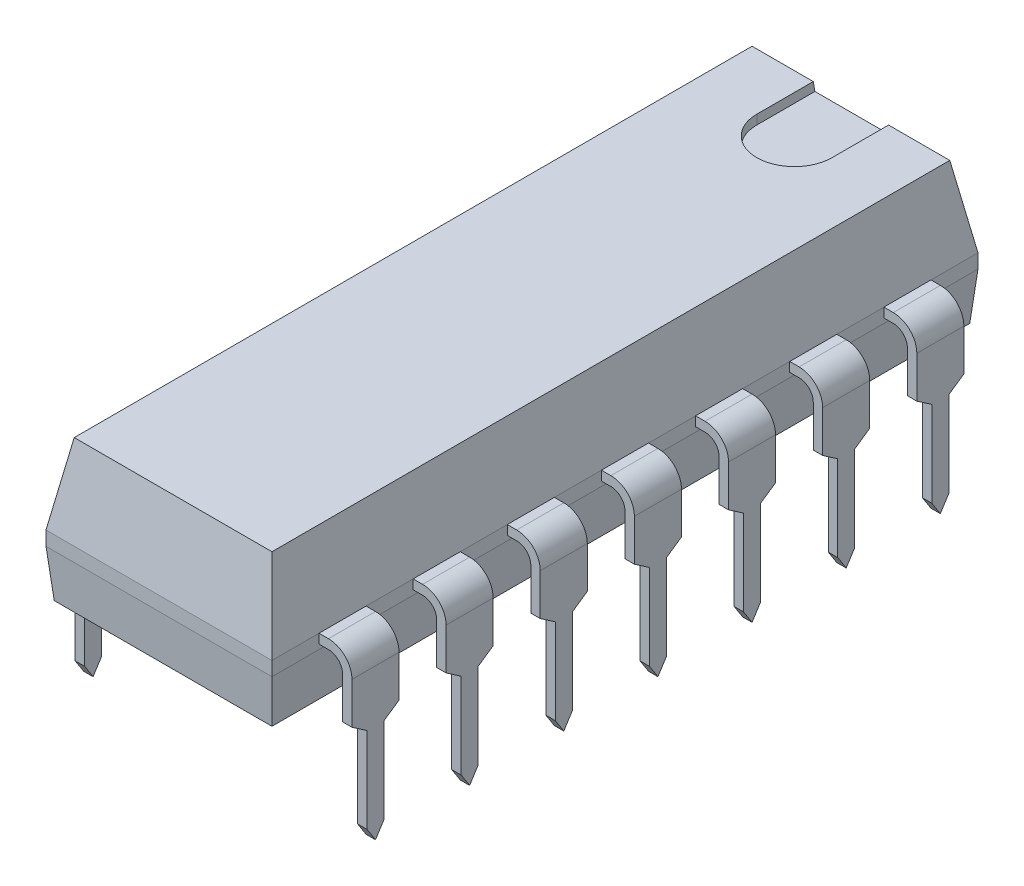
from build123d import *
from OCP.BRepFilletAPI import BRepFilletAPI_MakeChamfer

# Parameters (mm, degrees)
SKETCH1_W                = 19.05
SKETCH1_H                = 6.096
BASE_EXTRUDE_DEPTH       = 3.81
CHAMFER1_SIZE            = 2.159
CHAMFER1_SIZE2           = 0.380689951
CHAMFER2_SIZE            = 1.27
CHAMFER2_SIZE2           = 0.111110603
CUT_EXTRUDE1_DEPTH       = 0.254
BOSS_EXTRUDE_THIN1_DEPTH = 0.635
CUT_EXTRUDE2_DEPTH       = 0.254
CUT_EXTRUDE3_DEPTH       = 0.254
LPATTERN1_COUNT          = 7
LPATTERN1_PITCH          = 2.54
MIRROR1_COPY_1_DEPTH     = 0.635
MIRROR1_COPY_2_DEPTH     = 0.635
MIRROR1_COPY_3_DEPTH     = 0.635
MIRROR1_COPY_4_DEPTH     = 0.635
MIRROR1_COPY_5_DEPTH     = 0.635
MIRROR1_COPY_6_DEPTH     = 0.635
MIRROR1_COPY_7_DEPTH     = 0.254
MIRROR1_COPY_8_DEPTH     = 0.254
MIRROR1_COPY_9_DEPTH     = 0.254
MIRROR1_COPY_10_DEPTH    = 0.254
MIRROR1_COPY_11_DEPTH    = 0.254
MIRROR1_COPY_12_DEPTH    = 0.254
MIRROR1_COPY_13_DEPTH    = 0.254
MIRROR1_COPY_14_DEPTH    = 0.254
MIRROR1_COPY_15_DEPTH    = 0.254
MIRROR1_COPY_16_DEPTH    = 0.254
MIRROR1_COPY_17_DEPTH    = 0.254
MIRROR1_COPY_18_DEPTH    = 0.254


with BuildPart() as part:
    # Sketch1 → Base-Extrude (new body)
    with BuildSketch(Plane(origin=(0, 0.381, 0), x_dir=(0, 0, -1), z_dir=(0, 1, 0))):
        with Locations((-7.62, -3.81)):
            Rectangle(SKETCH1_W, SKETCH1_H)
    extrude(amount=BASE_EXTRUDE_DEPTH)

    # Chamfer1: one chamfer whose edges measure the first distance from different faces: ONE call of the kernel's chamfer builder (chamfer() names one face for all edges)
    chamfer1_edges_1 = [part.edges().sort_by_distance(p)[0] for p in [
        (3.81, 4.191, 17.145),
    ]]
    chamfer1_side_1 = [part.faces().sort_by_distance(p)[0] for p in [
        (3.81, 2.286, 17.145),
    ]]
    chamfer1_edges_2 = [part.edges().sort_by_distance(p)[0] for p in [
        (6.858, 4.191, 7.62),
    ]]
    chamfer1_side_2 = [part.faces().sort_by_distance(p)[0] for p in [
        (6.858, 2.286, 7.62),
    ]]
    chamfer1_edges_3 = [part.edges().sort_by_distance(p)[0] for p in [
        (3.81, 4.191, -1.905),
    ]]
    chamfer1_side_3 = [part.faces().sort_by_distance(p)[0] for p in [
        (3.81, 2.286, -1.905),
    ]]
    chamfer1_edges_4 = [part.edges().sort_by_distance(p)[0] for p in [
        (0.762, 4.191, 7.62),
    ]]
    chamfer1_side_4 = [part.faces().sort_by_distance(p)[0] for p in [
        (0.762, 2.286, 7.62),
    ]]
    chamfer1 = BRepFilletAPI_MakeChamfer(part.part.solid().wrapped)
    for e in chamfer1_edges_1:
        chamfer1.Add(CHAMFER1_SIZE, CHAMFER1_SIZE2, e.wrapped, chamfer1_side_1[0].wrapped)  # the first distance lies on this face
    for e in chamfer1_edges_2:
        chamfer1.Add(CHAMFER1_SIZE, CHAMFER1_SIZE2, e.wrapped, chamfer1_side_2[0].wrapped)  # the first distance lies on this face
    for e in chamfer1_edges_3:
        chamfer1.Add(CHAMFER1_SIZE, CHAMFER1_SIZE2, e.wrapped, chamfer1_side_3[0].wrapped)  # the first distance lies on this face
    for e in chamfer1_edges_4:
        chamfer1.Add(CHAMFER1_SIZE, CHAMFER1_SIZE2, e.wrapped, chamfer1_side_4[0].wrapped)  # the first distance lies on this face
    add(Compound.cast(chamfer1.Shape()), mode=Mode.REPLACE)

    # Chamfer2: one chamfer whose edges measure the first distance from different faces: ONE call of the kernel's chamfer builder (chamfer() names one face for all edges)
    chamfer2_edges_1 = [part.edges().sort_by_distance(p)[0] for p in [
        (6.858, 0.381, 7.62),
    ]]
    chamfer2_side_1 = [part.faces().sort_by_distance(p)[0] for p in [
        (6.858, 1.2065, 7.62),
    ]]
    chamfer2_edges_2 = [part.edges().sort_by_distance(p)[0] for p in [
        (3.81, 0.381, 17.145),
    ]]
    chamfer2_side_2 = [part.faces().sort_by_distance(p)[0] for p in [
        (3.81, 1.2065, 17.145),
    ]]
    chamfer2_edges_3 = [part.edges().sort_by_distance(p)[0] for p in [
        (0.762, 0.381, 7.62),
    ]]
    chamfer2_side_3 = [part.faces().sort_by_distance(p)[0] for p in [
        (0.762, 1.2065, 7.62),
    ]]
    chamfer2_edges_4 = [part.edges().sort_by_distance(p)[0] for p in [
        (3.81, 0.381, -1.905),
    ]]
    chamfer2_side_4 = [part.faces().sort_by_distance(p)[0] for p in [
        (3.81, 1.2065, -1.905),
    ]]
    chamfer2 = BRepFilletAPI_MakeChamfer(part.part.solid().wrapped)
    for e in chamfer2_edges_1:
        chamfer2.Add(CHAMFER2_SIZE, CHAMFER2_SIZE2, e.wrapped, chamfer2_side_1[0].wrapped)  # the first distance lies on this face
    for e in chamfer2_edges_2:
        chamfer2.Add(CHAMFER2_SIZE, CHAMFER2_SIZE2, e.wrapped, chamfer2_side_2[0].wrapped)  # the first distance lies on this face
    for e in chamfer2_edges_3:
        chamfer2.Add(CHAMFER2_SIZE, CHAMFER2_SIZE2, e.wrapped, chamfer2_side_3[0].wrapped)  # the first distance lies on this face
    for e in chamfer2_edges_4:
        chamfer2.Add(CHAMFER2_SIZE, CHAMFER2_SIZE2, e.wrapped, chamfer2_side_4[0].wrapped)  # the first distance lies on this face
    add(Compound.cast(chamfer2.Shape()), mode=Mode.REPLACE)

    # Sketch2 → Cut-Extrude1 (cut)
    with BuildSketch(Plane(origin=(0, 4.191, 0), x_dir=(-1, 0, 0), z_dir=(0, 1, 0))):
        with BuildLine():
            Line((-2.794, -1.905), (-4.826, -1.905))
            Line((-4.826, -1.905), (-4.826, -0.000310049))
            ThreePointArc((-4.826, -0.000310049), (-3.81, 1.015689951), (-2.794, -0.000310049))
            Line((-2.794, -0.000310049), (-2.794, -1.905))
        make_face()
    extrude(amount=-CUT_EXTRUDE1_DEPTH, mode=Mode.SUBTRACT)

    # Sketch3 → Boss-Extrude-Thin1 (add, symmetric)
    with BuildSketch(Plane(origin=(9.017, 0, 0), x_dir=(-1, 0, 0), z_dir=(0, 0, -1))):
        with BuildLine():
            Line((6.363952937, 1.778), (8.509, 1.778))
            ThreePointArc((8.509, 1.778), (8.778407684, 1.666407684), (8.89, 1.397))
            Line((8.89, 1.397), (8.89, -2.667))
            Line((8.89, -2.667), (9.144, -2.667))
            Line((9.144, -2.667), (9.144, 1.397))
            ThreePointArc((9.144, 1.397), (8.958012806, 1.846012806), (8.509, 2.032))
            Line((8.509, 2.032), (6.363952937, 2.032))
            Line((6.363952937, 2.032), (6.363952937, 1.778))
        make_face()
    boss_extrude_thin1 = extrude(amount=BOSS_EXTRUDE_THIN1_DEPTH, both=True)

    # Sketch4 → Cut-Extrude2 (cut)
    with BuildSketch(Plane(origin=(0.127, 0, 0), x_dir=(0, 0, -1), z_dir=(1, 0, 0))):
        Polygon((-0.635, 0.2794), (-0.2286, 0), (-0.2286, -2.309519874), (0, -2.667), (-0.635, -2.667), align=None)
    cut_extrude2 = extrude(amount=-CUT_EXTRUDE2_DEPTH, mode=Mode.SUBTRACT)

    # Sketch5 → Cut-Extrude3 (cut)
    with BuildSketch(Plane(origin=(0.127, 0, 0), x_dir=(0, 0, -1), z_dir=(1, 0, 0))):
        Polygon((0.635, -2.667), (0, -2.667), (0.2286, -2.309519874), (0.2286, 0), (0.635, 0.2794), align=None)
    cut_extrude3 = extrude(amount=-CUT_EXTRUDE3_DEPTH, mode=Mode.SUBTRACT)

    # LPattern1: Boss-Extrude-Thin1, Cut-Extrude2, Cut-Extrude3 ×7
    with Locations(*[(0, 0, i * LPATTERN1_PITCH) for i in range(1, LPATTERN1_COUNT)]):
        add(boss_extrude_thin1)
        add(cut_extrude2, mode=Mode.SUBTRACT)
        add(cut_extrude3, mode=Mode.SUBTRACT)

    # Mirror1: Boss-Extrude-Thin1, Cut-Extrude2, Cut-Extrude3 across plane
    add(boss_extrude_thin1.mirror(Plane(origin=(3.81, 0, 0), x_dir=(0, 0, 1), z_dir=(1, 0, 0))))
    add(cut_extrude2.mirror(Plane(origin=(3.81, 0, 0), x_dir=(0, 0, 1), z_dir=(1, 0, 0))), mode=Mode.SUBTRACT)
    add(cut_extrude3.mirror(Plane(origin=(3.81, 0, 0), x_dir=(0, 0, 1), z_dir=(1, 0, 0))), mode=Mode.SUBTRACT)

    # Mirror1 copy 1 sketch → Mirror1 copy 1 (add, symmetric)
    with BuildSketch(Plane(origin=(-1.397, 0, 2.54), x_dir=(1, 0, 0), z_dir=(0, 0, -1))):
        with BuildLine():
            Line((6.363952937, -1.778), (8.509, -1.778))
            ThreePointArc((8.509, -1.778), (8.778407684, -1.666407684), (8.89, -1.397))
            Line((8.89, -1.397), (8.89, 2.667))
            Line((8.89, 2.667), (9.144, 2.667))
            Line((9.144, 2.667), (9.144, -1.397))
            ThreePointArc((9.144, -1.397), (8.958012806, -1.846012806), (8.509, -2.032))
            Line((8.509, -2.032), (6.363952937, -2.032))
            Line((6.363952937, -2.032), (6.363952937, -1.778))
        make_face()
    extrude(amount=MIRROR1_COPY_1_DEPTH, both=True)

    # Mirror1 copy 2 sketch → Mirror1 copy 2 (add, symmetric)
    with BuildSketch(Plane(origin=(-1.397, 0, 5.08), x_dir=(1, 0, 0), z_dir=(0, 0, -1))):
        with BuildLine():
            Line((6.363952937, -1.778), (8.509, -1.778))
            ThreePointArc((8.509, -1.778), (8.778407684, -1.666407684), (8.89, -1.397))
            Line((8.89, -1.397), (8.89, 2.667))
            Line((8.89, 2.667), (9.144, 2.667))
            Line((9.144, 2.667), (9.144, -1.397))
            ThreePointArc((9.144, -1.397), (8.958012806, -1.846012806), (8.509, -2.032))
            Line((8.509, -2.032), (6.363952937, -2.032))
            Line((6.363952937, -2.032), (6.363952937, -1.778))
        make_face()
    extrude(amount=MIRROR1_COPY_2_DEPTH, both=True)

    # Mirror1 copy 3 sketch → Mirror1 copy 3 (add, symmetric)
    with BuildSketch(Plane(origin=(-1.397, 0, 7.62), x_dir=(1, 0, 0), z_dir=(0, 0, -1))):
        with BuildLine():
            Line((6.363952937, -1.778), (8.509, -1.778))
            ThreePointArc((8.509, -1.778), (8.778407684, -1.666407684), (8.89, -1.397))
            Line((8.89, -1.397), (8.89, 2.667))
            Line((8.89, 2.667), (9.144, 2.667))
            Line((9.144, 2.667), (9.144, -1.397))
            ThreePointArc((9.144, -1.397), (8.958012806, -1.846012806), (8.509, -2.032))
            Line((8.509, -2.032), (6.363952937, -2.032))
            Line((6.363952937, -2.032), (6.363952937, -1.778))
        make_face()
    extrude(amount=MIRROR1_COPY_3_DEPTH, both=True)

    # Mirror1 copy 4 sketch → Mirror1 copy 4 (add, symmetric)
    with BuildSketch(Plane(origin=(-1.397, 0, 10.16), x_dir=(1, 0, 0), z_dir=(0, 0, -1))):
        with BuildLine():
            Line((6.363952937, -1.778), (8.509, -1.778))
            ThreePointArc((8.509, -1.778), (8.778407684, -1.666407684), (8.89, -1.397))
            Line((8.89, -1.397), (8.89, 2.667))
            Line((8.89, 2.667), (9.144, 2.667))
            Line((9.144, 2.667), (9.144, -1.397))
            ThreePointArc((9.144, -1.397), (8.958012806, -1.846012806), (8.509, -2.032))
            Line((8.509, -2.032), (6.363952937, -2.032))
            Line((6.363952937, -2.032), (6.363952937, -1.778))
        make_face()
    extrude(amount=MIRROR1_COPY_4_DEPTH, both=True)

    # Mirror1 copy 5 sketch → Mirror1 copy 5 (add, symmetric)
    with BuildSketch(Plane(origin=(-1.397, 0, 12.7), x_dir=(1, 0, 0), z_dir=(0, 0, -1))):
        with BuildLine():
            Line((6.363952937, -1.778), (8.509, -1.778))
            ThreePointArc((8.509, -1.778), (8.778407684, -1.666407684), (8.89, -1.397))
            Line((8.89, -1.397), (8.89, 2.667))
            Line((8.89, 2.667), (9.144, 2.667))
            Line((9.144, 2.667), (9.144, -1.397))
            ThreePointArc((9.144, -1.397), (8.958012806, -1.846012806), (8.509, -2.032))
            Line((8.509, -2.032), (6.363952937, -2.032))
            Line((6.363952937, -2.032), (6.363952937, -1.778))
        make_face()
    extrude(amount=MIRROR1_COPY_5_DEPTH, both=True)

    # Mirror1 copy 6 sketch → Mirror1 copy 6 (add, symmetric)
    with BuildSketch(Plane(origin=(-1.397, 0, 15.24), x_dir=(1, 0, 0), z_dir=(0, 0, -1))):
        with BuildLine():
            Line((6.363952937, -1.778), (8.509, -1.778))
            ThreePointArc((8.509, -1.778), (8.778407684, -1.666407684), (8.89, -1.397))
            Line((8.89, -1.397), (8.89, 2.667))
            Line((8.89, 2.667), (9.144, 2.667))
            Line((9.144, 2.667), (9.144, -1.397))
            ThreePointArc((9.144, -1.397), (8.958012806, -1.846012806), (8.509, -2.032))
            Line((8.509, -2.032), (6.363952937, -2.032))
            Line((6.363952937, -2.032), (6.363952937, -1.778))
        make_face()
    extrude(amount=MIRROR1_COPY_6_DEPTH, both=True)

    # Mirror1 copy 7 sketch → Mirror1 copy 7 (cut)
    with BuildSketch(Plane(origin=(7.493, 0, 2.54), x_dir=(0, 0, -1), z_dir=(-1, 0, 0))):
        Polygon((-0.635, -0.2794), (-0.2286, 0), (-0.2286, 2.309519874), (0, 2.667), (-0.635, 2.667), align=None)
    extrude(amount=-MIRROR1_COPY_7_DEPTH, mode=Mode.SUBTRACT)

    # Mirror1 copy 8 sketch → Mirror1 copy 8 (cut)
    with BuildSketch(Plane(origin=(7.493, 0, 5.08), x_dir=(0, 0, -1), z_dir=(-1, 0, 0))):
        Polygon((-0.635, -0.2794), (-0.2286, 0), (-0.2286, 2.309519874), (0, 2.667), (-0.635, 2.667), align=None)
    extrude(amount=-MIRROR1_COPY_8_DEPTH, mode=Mode.SUBTRACT)

    # Mirror1 copy 9 sketch → Mirror1 copy 9 (cut)
    with BuildSketch(Plane(origin=(7.493, 0, 7.62), x_dir=(0, 0, -1), z_dir=(-1, 0, 0))):
        Polygon((-0.635, -0.2794), (-0.2286, 0), (-0.2286, 2.309519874), (0, 2.667), (-0.635, 2.667), align=None)
    extrude(amount=-MIRROR1_COPY_9_DEPTH, mode=Mode.SUBTRACT)

    # Mirror1 copy 10 sketch → Mirror1 copy 10 (cut)
    with BuildSketch(Plane(origin=(7.493, 0, 10.16), x_dir=(0, 0, -1), z_dir=(-1, 0, 0))):
        Polygon((-0.635, -0.2794), (-0.2286, 0), (-0.2286, 2.309519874), (0, 2.667), (-0.635, 2.667), align=None)
    extrude(amount=-MIRROR1_COPY_10_DEPTH, mode=Mode.SUBTRACT)

    # Mirror1 copy 11 sketch → Mirror1 copy 11 (cut)
    with BuildSketch(Plane(origin=(7.493, 0, 12.7), x_dir=(0, 0, -1), z_dir=(-1, 0, 0))):
        Polygon((-0.635, -0.2794), (-0.2286, 0), (-0.2286, 2.309519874), (0, 2.667), (-0.635, 2.667), align=None)
    extrude(amount=-MIRROR1_COPY_11_DEPTH, mode=Mode.SUBTRACT)

    # Mirror1 copy 12 sketch → Mirror1 copy 12 (cut)
    with BuildSketch(Plane(origin=(7.493, 0, 15.24), x_dir=(0, 0, -1), z_dir=(-1, 0, 0))):
        Polygon((-0.635, -0.2794), (-0.2286, 0), (-0.2286, 2.309519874), (0, 2.667), (-0.635, 2.667), align=None)
    extrude(amount=-MIRROR1_COPY_12_DEPTH, mode=Mode.SUBTRACT)

    # Mirror1 copy 13 sketch → Mirror1 copy 13 (cut)
    with BuildSketch(Plane(origin=(7.493, 0, 2.54), x_dir=(0, 0, -1), z_dir=(-1, 0, 0))):
        Polygon((0.635, 2.667), (0, 2.667), (0.2286, 2.309519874), (0.2286, 0), (0.635, -0.2794), align=None)
    extrude(amount=-MIRROR1_COPY_13_DEPTH, mode=Mode.SUBTRACT)

    # Mirror1 copy 14 sketch → Mirror1 copy 14 (cut)
    with BuildSketch(Plane(origin=(7.493, 0, 5.08), x_dir=(0, 0, -1), z_dir=(-1, 0, 0))):
        Polygon((0.635, 2.667), (0, 2.667), (0.2286, 2.309519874), (0.2286, 0), (0.635, -0.2794), align=None)
    extrude(amount=-MIRROR1_COPY_14_DEPTH, mode=Mode.SUBTRACT)

    # Mirror1 copy 15 sketch → Mirror1 copy 15 (cut)
    with BuildSketch(Plane(origin=(7.493, 0, 7.62), x_dir=(0, 0, -1), z_dir=(-1, 0, 0))):
        Polygon((0.635, 2.667), (0, 2.667), (0.2286, 2.309519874), (0.2286, 0), (0.635, -0.2794), align=None)
    extrude(amount=-MIRROR1_COPY_15_DEPTH, mode=Mode.SUBTRACT)

    # Mirror1 copy 16 sketch → Mirror1 copy 16 (cut)
    with BuildSketch(Plane(origin=(7.493, 0, 10.16), x_dir=(0, 0, -1), z_dir=(-1, 0, 0))):
        Polygon((0.635, 2.667), (0, 2.667), (0.2286, 2.309519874), (0.2286, 0), (0.635, -0.2794), align=None)
    extrude(amount=-MIRROR1_COPY_16_DEPTH, mode=Mode.SUBTRACT)

    # Mirror1 copy 17 sketch → Mirror1 copy 17 (cut)
    with BuildSketch(Plane(origin=(7.493, 0, 12.7), x_dir=(0, 0, -1), z_dir=(-1, 0, 0))):
        Polygon((0.635, 2.667), (0, 2.667), (0.2286, 2.309519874), (0.2286, 0), (0.635, -0.2794), align=None)
    extrude(amount=-MIRROR1_COPY_17_DEPTH, mode=Mode.SUBTRACT)

    # Mirror1 copy 18 sketch → Mirror1 copy 18 (cut)
    with BuildSketch(Plane(origin=(7.493, 0, 15.24), x_dir=(0, 0, -1), z_dir=(-1, 0, 0))):
        Polygon((0.635, 2.667), (0, 2.667), (0.2286, 2.309519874), (0.2286, 0), (0.635, -0.2794), align=None)
    extrude(amount=-MIRROR1_COPY_18_DEPTH, mode=Mode.SUBTRACT)


solid = part.part
